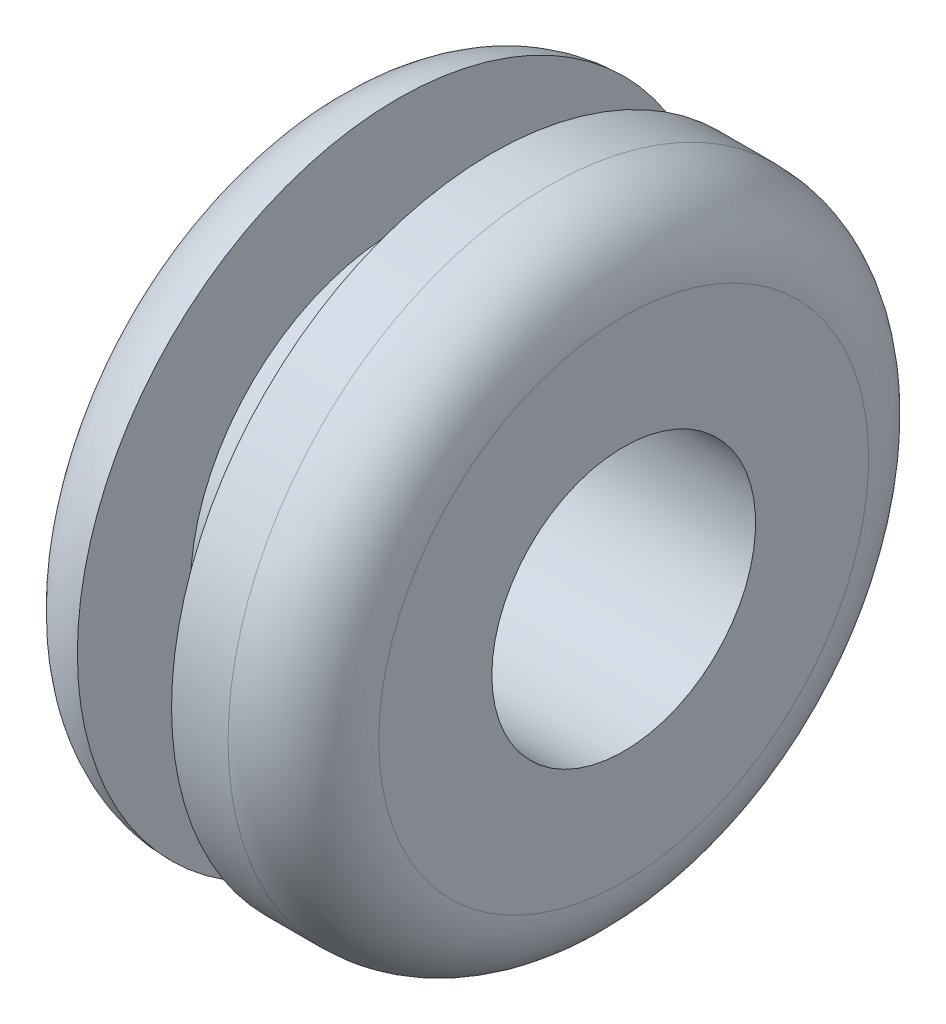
from build123d import *


with BuildPart() as part:
    # Esquisse1 → R_volution1 (revolve)
    with BuildSketch(Plane.XY, mode=Mode.PRIVATE) as r_volution1_sk:
        with BuildLine():
            Line((0, 3.5), (0, 6.5))
            ThreePointArc((0, 6.5), (0.585786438, 7.914213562), (2, 8.5))
            Line((2, 8.5), (2, 5.5))
            Line((2, 5.5), (4.5, 5.5))
            Line((4.5, 5.5), (4.5, 8.5))
            Line((4.5, 8.5), (6, 8.5))
            ThreePointArc((6, 8.5), (7.414213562, 7.914213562), (8, 6.5))
            Line((8, 6.5), (8, 3.5))
            Line((8, 3.5), (0, 3.5))
        make_face()
    revolve(r_volution1_sk.sketch.rotate(Axis((0, 0, 0), (1, 0, 0)), 90), axis=Axis((0, 0, 0), (1, 0, 0)))


solid = part.part
